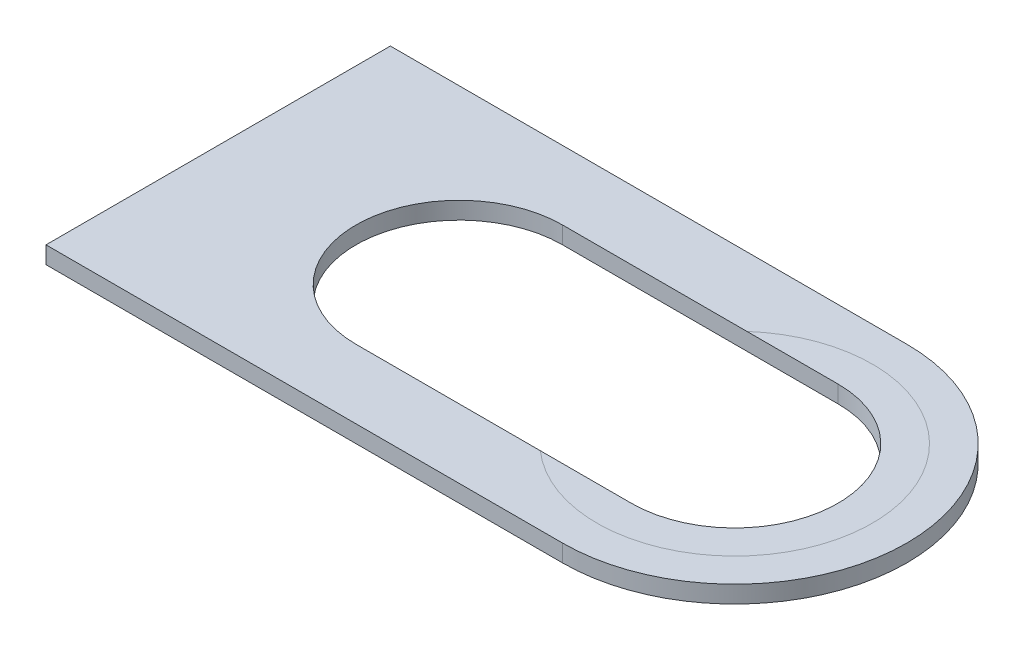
ISO-10303-21;
HEADER;
FILE_DESCRIPTION(('STEP AP214'),'2;1');
FILE_NAME('part.step','',(''),(''),'','','');
FILE_SCHEMA(('AUTOMOTIVE_DESIGN { 1 0 10303 214 1 1 1 1 }'));
ENDSEC;
DATA;
#1=APPLICATION_CONTEXT('core data for automotive mechanical design processes');
#2=APPLICATION_PROTOCOL_DEFINITION('international standard','automotive_design',2000,#1);
#3=PRODUCT_CONTEXT('',#1,'mechanical');
#4=PRODUCT('Part','Part','',(#3));
#5=PRODUCT_RELATED_PRODUCT_CATEGORY('part','',(#4));
#6=PRODUCT_DEFINITION_FORMATION('','',#4);
#7=PRODUCT_DEFINITION_CONTEXT('part definition',#1,'design');
#8=PRODUCT_DEFINITION('design','',#6,#7);
#9=PRODUCT_DEFINITION_SHAPE('','',#8);
#10=(LENGTH_UNIT() NAMED_UNIT(*) SI_UNIT(.MILLI.,.METRE.));
#11=(NAMED_UNIT(*) PLANE_ANGLE_UNIT() SI_UNIT($,.RADIAN.));
#12=(NAMED_UNIT(*) SI_UNIT($,.STERADIAN.) SOLID_ANGLE_UNIT());
#13=UNCERTAINTY_MEASURE_WITH_UNIT(LENGTH_MEASURE(1.E-05),#10,'distance_accuracy_value','');
#14=(GEOMETRIC_REPRESENTATION_CONTEXT(3) GLOBAL_UNCERTAINTY_ASSIGNED_CONTEXT((#13)) GLOBAL_UNIT_ASSIGNED_CONTEXT((#10,
#11,#12)) REPRESENTATION_CONTEXT('',''));
#15=CARTESIAN_POINT('',(0.,0.,0.));
#16=DIRECTION('',(0.,0.,1.));
#17=DIRECTION('',(1.,0.,0.));
#18=AXIS2_PLACEMENT_3D('',#15,#16,#17);
#19=CARTESIAN_POINT('',(0.,5.,50.));
#20=DIRECTION('',(0.,-1.,0.));
#21=DIRECTION('',(1.,0.,0.));
#22=AXIS2_PLACEMENT_3D('',#19,#20,#21);
#23=PLANE('',#22);
#24=CARTESIAN_POINT('',(-50.,4.99999999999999,0.));
#25=DIRECTION('',(0.,1.,0.));
#26=DIRECTION('',(-1.,0.,0.));
#27=AXIS2_PLACEMENT_3D('',#24,#25,#26);
#28=CIRCLE('',#27,50.);
#29=CARTESIAN_POINT('',(-50.,4.99999999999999,50.));
#30=VERTEX_POINT('',#29);
#31=CARTESIAN_POINT('',(-50.,4.99999999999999,-50.));
#32=VERTEX_POINT('',#31);
#33=EDGE_CURVE('P0_E145',#30,#32,#28,.T.);
#34=ORIENTED_EDGE('',*,*,#33,.T.);
#35=DIRECTION('',(-1.,0.,0.));
#36=VECTOR('',#35,1.);
#37=CARTESIAN_POINT('',(0.,5.,-50.));
#38=LINE('',#37,#36);
#39=CARTESIAN_POINT('',(-200.,4.99999999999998,-50.));
#40=VERTEX_POINT('',#39);
#41=EDGE_CURVE('P0_E154',#32,#40,#38,.T.);
#42=ORIENTED_EDGE('',*,*,#41,.T.);
#43=DIRECTION('',(0.,0.,-1.));
#44=VECTOR('',#43,1.);
#45=CARTESIAN_POINT('',(-200.,4.99999999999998,50.));
#46=LINE('',#45,#44);
#47=CARTESIAN_POINT('',(-200.,4.99999999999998,50.));
#48=VERTEX_POINT('',#47);
#49=EDGE_CURVE('P0_E43',#48,#40,#46,.T.);
#50=ORIENTED_EDGE('',*,*,#49,.F.);
#51=DIRECTION('',(-1.,0.,0.));
#52=VECTOR('',#51,1.);
#53=CARTESIAN_POINT('',(0.,5.,50.));
#54=LINE('',#53,#52);
#55=EDGE_CURVE('P0_E161',#30,#48,#54,.T.);
#56=ORIENTED_EDGE('',*,*,#55,.F.);
#57=EDGE_LOOP('',(#34,#42,#50,#56));
#58=FACE_BOUND('',#57,.T.);
#59=CARTESIAN_POINT('',(-50.,4.99999999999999,0.));
#60=DIRECTION('',(0.,-1.,0.));
#61=DIRECTION('',(1.,0.,0.));
#62=AXIS2_PLACEMENT_3D('',#59,#60,#61);
#63=CIRCLE('',#62,40.);
#64=CARTESIAN_POINT('',(-76.4575131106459,4.99999999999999,30.));
#65=VERTEX_POINT('',#64);
#66=CARTESIAN_POINT('',(-76.4575131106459,4.99999999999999,-30.));
#67=VERTEX_POINT('',#66);
#68=EDGE_CURVE('P0_E11',#65,#67,#63,.F.);
#69=ORIENTED_EDGE('',*,*,#68,.F.);
#70=DIRECTION('',(1.,0.,0.));
#71=VECTOR('',#70,1.);
#72=CARTESIAN_POINT('',(-50.,4.99999999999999,30.));
#73=LINE('',#72,#71);
#74=CARTESIAN_POINT('',(-130.,4.99999999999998,30.));
#75=VERTEX_POINT('',#74);
#76=EDGE_CURVE('P0_E124',#75,#65,#73,.T.);
#77=ORIENTED_EDGE('',*,*,#76,.F.);
#78=CARTESIAN_POINT('',(-130.,4.99999999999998,0.));
#79=DIRECTION('',(0.,1.,0.));
#80=DIRECTION('',(-1.,0.,0.));
#81=AXIS2_PLACEMENT_3D('',#78,#79,#80);
#82=CIRCLE('',#81,30.);
#83=CARTESIAN_POINT('',(-130.,4.99999999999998,-30.));
#84=VERTEX_POINT('',#83);
#85=EDGE_CURVE('P0_E117',#84,#75,#82,.T.);
#86=ORIENTED_EDGE('',*,*,#85,.F.);
#87=DIRECTION('',(-1.,0.,0.));
#88=VECTOR('',#87,1.);
#89=CARTESIAN_POINT('',(-50.,4.99999999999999,-30.));
#90=LINE('',#89,#88);
#91=EDGE_CURVE('P0_E103',#67,#84,#90,.T.);
#92=ORIENTED_EDGE('',*,*,#91,.F.);
#93=EDGE_LOOP('',(#69,#77,#86,#92));
#94=FACE_BOUND('',#93,.T.);
#95=ADVANCED_FACE('P0_F34',(#58,#94),#23,.F.);
#96=CARTESIAN_POINT('',(-50.,4.99999999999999,0.));
#97=DIRECTION('',(0.,-1.,0.));
#98=DIRECTION('',(1.,0.,0.));
#99=AXIS2_PLACEMENT_3D('',#96,#97,#98);
#100=CYLINDRICAL_SURFACE('',#99,50.);
#101=DIRECTION('',(0.,-1.,0.));
#102=VECTOR('',#101,1.);
#103=CARTESIAN_POINT('',(-50.,4.99999999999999,-50.));
#104=LINE('',#103,#102);
#105=CARTESIAN_POINT('',(-50.,0.,-50.));
#106=VERTEX_POINT('',#105);
#107=EDGE_CURVE('P0_E147',#32,#106,#104,.T.);
#108=ORIENTED_EDGE('',*,*,#107,.F.);
#109=ORIENTED_EDGE('',*,*,#33,.F.);
#110=DIRECTION('',(0.,-1.,0.));
#111=VECTOR('',#110,1.);
#112=CARTESIAN_POINT('',(-50.,4.99999999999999,50.));
#113=LINE('',#112,#111);
#114=CARTESIAN_POINT('',(-50.,0.,50.));
#115=VERTEX_POINT('',#114);
#116=EDGE_CURVE('P0_E142',#30,#115,#113,.T.);
#117=ORIENTED_EDGE('',*,*,#116,.T.);
#118=CARTESIAN_POINT('',(-50.,0.,0.));
#119=DIRECTION('',(0.,-1.,0.));
#120=DIRECTION('',(1.,0.,0.));
#121=AXIS2_PLACEMENT_3D('',#118,#119,#120);
#122=CIRCLE('',#121,50.);
#123=EDGE_CURVE('P0_E149',#115,#106,#122,.F.);
#124=ORIENTED_EDGE('',*,*,#123,.T.);
#125=EDGE_LOOP('',(#108,#109,#117,#124));
#126=FACE_BOUND('',#125,.T.);
#127=ADVANCED_FACE('P0_F191',(#126),#100,.T.);
#128=CARTESIAN_POINT('',(0.,5.,50.));
#129=DIRECTION('',(0.,0.,1.));
#130=DIRECTION('',(1.,0.,0.));
#131=AXIS2_PLACEMENT_3D('',#128,#129,#130);
#132=PLANE('',#131);
#133=DIRECTION('',(-1.,0.,0.));
#134=VECTOR('',#133,1.);
#135=CARTESIAN_POINT('',(0.,0.,50.));
#136=LINE('',#135,#134);
#137=CARTESIAN_POINT('',(-200.,0.,50.));
#138=VERTEX_POINT('',#137);
#139=EDGE_CURVE('P0_E166',#115,#138,#136,.T.);
#140=ORIENTED_EDGE('',*,*,#139,.F.);
#141=ORIENTED_EDGE('',*,*,#116,.F.);
#142=ORIENTED_EDGE('',*,*,#55,.T.);
#143=DIRECTION('',(0.,1.,0.));
#144=VECTOR('',#143,1.);
#145=CARTESIAN_POINT('',(-200.,0.,50.));
#146=LINE('',#145,#144);
#147=EDGE_CURVE('P0_E163',#138,#48,#146,.T.);
#148=ORIENTED_EDGE('',*,*,#147,.F.);
#149=EDGE_LOOP('',(#140,#141,#142,#148));
#150=FACE_BOUND('',#149,.T.);
#151=ADVANCED_FACE('P0_F188',(#150),#132,.T.);
#152=CARTESIAN_POINT('',(0.,5.,-50.));
#153=DIRECTION('',(0.,0.,1.));
#154=DIRECTION('',(1.,0.,0.));
#155=AXIS2_PLACEMENT_3D('',#152,#153,#154);
#156=PLANE('',#155);
#157=ORIENTED_EDGE('',*,*,#107,.T.);
#158=DIRECTION('',(-1.,0.,0.));
#159=VECTOR('',#158,1.);
#160=CARTESIAN_POINT('',(0.,0.,-50.));
#161=LINE('',#160,#159);
#162=CARTESIAN_POINT('',(-200.,0.,-50.));
#163=VERTEX_POINT('',#162);
#164=EDGE_CURVE('P0_E159',#106,#163,#161,.T.);
#165=ORIENTED_EDGE('',*,*,#164,.T.);
#166=DIRECTION('',(0.,1.,0.));
#167=VECTOR('',#166,1.);
#168=CARTESIAN_POINT('',(-200.,0.,-50.));
#169=LINE('',#168,#167);
#170=EDGE_CURVE('P0_E156',#163,#40,#169,.T.);
#171=ORIENTED_EDGE('',*,*,#170,.T.);
#172=ORIENTED_EDGE('',*,*,#41,.F.);
#173=EDGE_LOOP('',(#157,#165,#171,#172));
#174=FACE_BOUND('',#173,.T.);
#175=ADVANCED_FACE('P0_F181',(#174),#156,.F.);
#176=CARTESIAN_POINT('',(-50.,4.99999999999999,30.));
#177=VERTEX_POINT('',#176);
#178=EDGE_CURVE('P0_E125',#65,#177,#73,.T.);
#179=ORIENTED_EDGE('',*,*,#178,.F.);
#180=ORIENTED_EDGE('',*,*,#68,.T.);
#181=CARTESIAN_POINT('',(-50.,4.99999999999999,-30.));
#182=VERTEX_POINT('',#181);
#183=EDGE_CURVE('P0_E110',#182,#67,#90,.T.);
#184=ORIENTED_EDGE('',*,*,#183,.F.);
#185=CARTESIAN_POINT('',(-50.,4.99999999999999,0.));
#186=DIRECTION('',(0.,1.,0.));
#187=DIRECTION('',(-1.,0.,0.));
#188=AXIS2_PLACEMENT_3D('',#185,#186,#187);
#189=CIRCLE('',#188,30.);
#190=EDGE_CURVE('P0_E112',#177,#182,#189,.T.);
#191=ORIENTED_EDGE('',*,*,#190,.F.);
#192=EDGE_LOOP('',(#179,#180,#184,#191));
#193=FACE_BOUND('',#192,.T.);
#194=ADVANCED_FACE('P0_F36',(#193),#23,.F.);
#195=CARTESIAN_POINT('',(-200.,0.,50.));
#196=DIRECTION('',(-1.,0.,0.));
#197=DIRECTION('',(0.,0.,1.));
#198=AXIS2_PLACEMENT_3D('',#195,#196,#197);
#199=PLANE('',#198);
#200=ORIENTED_EDGE('',*,*,#170,.F.);
#201=DIRECTION('',(0.,0.,-1.));
#202=VECTOR('',#201,1.);
#203=CARTESIAN_POINT('',(-200.,0.,50.));
#204=LINE('',#203,#202);
#205=EDGE_CURVE('P0_E168',#138,#163,#204,.T.);
#206=ORIENTED_EDGE('',*,*,#205,.F.);
#207=ORIENTED_EDGE('',*,*,#147,.T.);
#208=ORIENTED_EDGE('',*,*,#49,.T.);
#209=EDGE_LOOP('',(#200,#206,#207,#208));
#210=FACE_BOUND('',#209,.T.);
#211=ADVANCED_FACE('P0_F174',(#210),#199,.T.);
#212=CARTESIAN_POINT('',(0.,0.,50.));
#213=DIRECTION('',(0.,-1.,0.));
#214=DIRECTION('',(1.,0.,0.));
#215=AXIS2_PLACEMENT_3D('',#212,#213,#214);
#216=PLANE('',#215);
#217=CARTESIAN_POINT('',(-50.,0.,0.));
#218=DIRECTION('',(0.,1.,0.));
#219=DIRECTION('',(-1.,0.,0.));
#220=AXIS2_PLACEMENT_3D('',#217,#218,#219);
#221=CIRCLE('',#220,30.);
#222=CARTESIAN_POINT('',(-50.,0.,30.));
#223=VERTEX_POINT('',#222);
#224=CARTESIAN_POINT('',(-50.,0.,-30.));
#225=VERTEX_POINT('',#224);
#226=EDGE_CURVE('P0_E130',#223,#225,#221,.T.);
#227=ORIENTED_EDGE('',*,*,#226,.T.);
#228=DIRECTION('',(-1.,0.,0.));
#229=VECTOR('',#228,1.);
#230=CARTESIAN_POINT('',(-50.,0.,-30.));
#231=LINE('',#230,#229);
#232=CARTESIAN_POINT('',(-130.,0.,-30.));
#233=VERTEX_POINT('',#232);
#234=EDGE_CURVE('P0_E133',#225,#233,#231,.T.);
#235=ORIENTED_EDGE('',*,*,#234,.T.);
#236=CARTESIAN_POINT('',(-130.,0.,0.));
#237=DIRECTION('',(0.,1.,0.));
#238=DIRECTION('',(-1.,0.,0.));
#239=AXIS2_PLACEMENT_3D('',#236,#237,#238);
#240=CIRCLE('',#239,30.);
#241=CARTESIAN_POINT('',(-130.,0.,30.));
#242=VERTEX_POINT('',#241);
#243=EDGE_CURVE('P0_E119',#233,#242,#240,.T.);
#244=ORIENTED_EDGE('',*,*,#243,.T.);
#245=DIRECTION('',(1.,0.,0.));
#246=VECTOR('',#245,1.);
#247=CARTESIAN_POINT('',(-50.,0.,30.));
#248=LINE('',#247,#246);
#249=EDGE_CURVE('P0_E136',#242,#223,#248,.T.);
#250=ORIENTED_EDGE('',*,*,#249,.T.);
#251=EDGE_LOOP('',(#227,#235,#244,#250));
#252=FACE_BOUND('',#251,.T.);
#253=ORIENTED_EDGE('',*,*,#123,.F.);
#254=ORIENTED_EDGE('',*,*,#139,.T.);
#255=ORIENTED_EDGE('',*,*,#205,.T.);
#256=ORIENTED_EDGE('',*,*,#164,.F.);
#257=EDGE_LOOP('',(#253,#254,#255,#256));
#258=FACE_BOUND('',#257,.T.);
#259=ADVANCED_FACE('P0_F185',(#252,#258),#216,.T.);
#260=CARTESIAN_POINT('',(-50.,0.,0.));
#261=DIRECTION('',(0.,1.,0.));
#262=DIRECTION('',(-1.,0.,0.));
#263=AXIS2_PLACEMENT_3D('',#260,#261,#262);
#264=CYLINDRICAL_SURFACE('',#263,30.);
#265=ORIENTED_EDGE('',*,*,#190,.T.);
#266=DIRECTION('',(0.,1.,0.));
#267=VECTOR('',#266,1.);
#268=CARTESIAN_POINT('',(-50.,0.,-30.));
#269=LINE('',#268,#267);
#270=EDGE_CURVE('P0_E121',#225,#182,#269,.T.);
#271=ORIENTED_EDGE('',*,*,#270,.F.);
#272=ORIENTED_EDGE('',*,*,#226,.F.);
#273=DIRECTION('',(0.,1.,0.));
#274=VECTOR('',#273,1.);
#275=CARTESIAN_POINT('',(-50.,0.,30.));
#276=LINE('',#275,#274);
#277=EDGE_CURVE('P0_E139',#223,#177,#276,.T.);
#278=ORIENTED_EDGE('',*,*,#277,.T.);
#279=EDGE_LOOP('',(#265,#271,#272,#278));
#280=FACE_BOUND('',#279,.T.);
#281=ADVANCED_FACE('P0_F202',(#280),#264,.F.);
#282=CARTESIAN_POINT('',(-50.,0.,30.));
#283=DIRECTION('',(0.,0.,1.));
#284=DIRECTION('',(1.,0.,0.));
#285=AXIS2_PLACEMENT_3D('',#282,#283,#284);
#286=PLANE('',#285);
#287=ORIENTED_EDGE('',*,*,#76,.T.);
#288=ORIENTED_EDGE('',*,*,#178,.T.);
#289=ORIENTED_EDGE('',*,*,#277,.F.);
#290=ORIENTED_EDGE('',*,*,#249,.F.);
#291=DIRECTION('',(0.,1.,0.));
#292=VECTOR('',#291,1.);
#293=CARTESIAN_POINT('',(-130.,0.,30.));
#294=LINE('',#293,#292);
#295=EDGE_CURVE('P0_E120',#242,#75,#294,.T.);
#296=ORIENTED_EDGE('',*,*,#295,.T.);
#297=EDGE_LOOP('',(#287,#288,#289,#290,#296));
#298=FACE_BOUND('',#297,.T.);
#299=ADVANCED_FACE('P0_F214',(#298),#286,.F.);
#300=CARTESIAN_POINT('',(-130.,0.,0.));
#301=DIRECTION('',(0.,1.,0.));
#302=DIRECTION('',(-1.,0.,0.));
#303=AXIS2_PLACEMENT_3D('',#300,#301,#302);
#304=CYLINDRICAL_SURFACE('',#303,30.);
#305=ORIENTED_EDGE('',*,*,#85,.T.);
#306=ORIENTED_EDGE('',*,*,#295,.F.);
#307=ORIENTED_EDGE('',*,*,#243,.F.);
#308=DIRECTION('',(0.,1.,0.));
#309=VECTOR('',#308,1.);
#310=CARTESIAN_POINT('',(-130.,0.,-30.));
#311=LINE('',#310,#309);
#312=EDGE_CURVE('P0_E107',#233,#84,#311,.T.);
#313=ORIENTED_EDGE('',*,*,#312,.T.);
#314=EDGE_LOOP('',(#305,#306,#307,#313));
#315=FACE_BOUND('',#314,.T.);
#316=ADVANCED_FACE('P0_F116',(#315),#304,.F.);
#317=CARTESIAN_POINT('',(-50.,0.,-30.));
#318=DIRECTION('',(0.,0.,-1.));
#319=DIRECTION('',(-1.,0.,0.));
#320=AXIS2_PLACEMENT_3D('',#317,#318,#319);
#321=PLANE('',#320);
#322=ORIENTED_EDGE('',*,*,#183,.T.);
#323=ORIENTED_EDGE('',*,*,#91,.T.);
#324=ORIENTED_EDGE('',*,*,#312,.F.);
#325=ORIENTED_EDGE('',*,*,#234,.F.);
#326=ORIENTED_EDGE('',*,*,#270,.T.);
#327=EDGE_LOOP('',(#322,#323,#324,#325,#326));
#328=FACE_BOUND('',#327,.T.);
#329=ADVANCED_FACE('P0_F105',(#328),#321,.F.);
#330=CLOSED_SHELL('',(#95,#127,#151,#175,#194,#211,#259,#281,#299,#316,#329));
#331=MANIFOLD_SOLID_BREP('P0_B2',#330);
#332=CARTESIAN_POINT('',(0.,2.5,50.));
#333=DIRECTION('',(0.,-1.,0.));
#334=DIRECTION('',(1.,0.,0.));
#335=AXIS2_PLACEMENT_3D('',#332,#333,#334);
#336=PLANE('',#335);
#337=DIRECTION('',(1.,0.,0.));
#338=VECTOR('',#337,1.);
#339=CARTESIAN_POINT('',(0.,2.5,-50.));
#340=LINE('',#339,#338);
#341=CARTESIAN_POINT('',(-200.,2.49999999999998,-50.));
#342=VERTEX_POINT('',#341);
#343=CARTESIAN_POINT('',(-50.,2.49999999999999,-50.));
#344=VERTEX_POINT('',#343);
#345=EDGE_CURVE('P1_E22',#342,#344,#340,.T.);
#346=ORIENTED_EDGE('',*,*,#345,.T.);
#347=CARTESIAN_POINT('',(-50.,2.49999999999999,0.));
#348=DIRECTION('',(0.,1.,0.));
#349=DIRECTION('',(1.,0.,0.));
#350=AXIS2_PLACEMENT_3D('',#347,#348,#349);
#351=CIRCLE('',#350,50.);
#352=CARTESIAN_POINT('',(-50.,2.49999999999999,50.));
#353=VERTEX_POINT('',#352);
#354=EDGE_CURVE('P1_E70',#344,#353,#351,.F.);
#355=ORIENTED_EDGE('',*,*,#354,.T.);
#356=DIRECTION('',(-1.,0.,0.));
#357=VECTOR('',#356,1.);
#358=CARTESIAN_POINT('',(0.,2.5,50.));
#359=LINE('',#358,#357);
#360=CARTESIAN_POINT('',(-200.,2.49999999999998,50.));
#361=VERTEX_POINT('',#360);
#362=EDGE_CURVE('P1_E72',#353,#361,#359,.T.);
#363=ORIENTED_EDGE('',*,*,#362,.T.);
#364=DIRECTION('',(0.,0.,-1.));
#365=VECTOR('',#364,1.);
#366=CARTESIAN_POINT('',(-200.,2.49999999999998,50.));
#367=LINE('',#366,#365);
#368=EDGE_CURVE('P1_E75',#361,#342,#367,.T.);
#369=ORIENTED_EDGE('',*,*,#368,.T.);
#370=EDGE_LOOP('',(#346,#355,#363,#369));
#371=FACE_BOUND('',#370,.T.);
#372=DIRECTION('',(1.,0.,0.));
#373=VECTOR('',#372,1.);
#374=CARTESIAN_POINT('',(0.,2.5,30.));
#375=LINE('',#374,#373);
#376=CARTESIAN_POINT('',(-130.,2.49999999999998,30.));
#377=VERTEX_POINT('',#376);
#378=CARTESIAN_POINT('',(-76.4575131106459,2.49999999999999,30.));
#379=VERTEX_POINT('',#378);
#380=EDGE_CURVE('P1_E18',#377,#379,#375,.T.);
#381=ORIENTED_EDGE('',*,*,#380,.T.);
#382=CARTESIAN_POINT('',(-50.,2.49999999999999,0.));
#383=DIRECTION('',(0.,-1.,0.));
#384=DIRECTION('',(1.,0.,0.));
#385=AXIS2_PLACEMENT_3D('',#382,#383,#384);
#386=CIRCLE('',#385,40.);
#387=CARTESIAN_POINT('',(-76.4575131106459,2.49999999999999,-30.));
#388=VERTEX_POINT('',#387);
#389=EDGE_CURVE('P1_E11',#379,#388,#386,.F.);
#390=ORIENTED_EDGE('',*,*,#389,.T.);
#391=DIRECTION('',(-1.,0.,0.));
#392=VECTOR('',#391,1.);
#393=CARTESIAN_POINT('',(0.,2.5,-30.));
#394=LINE('',#393,#392);
#395=CARTESIAN_POINT('',(-130.,2.49999999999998,-30.));
#396=VERTEX_POINT('',#395);
#397=EDGE_CURVE('P1_E59',#388,#396,#394,.T.);
#398=ORIENTED_EDGE('',*,*,#397,.T.);
#399=CARTESIAN_POINT('',(-130.,2.49999999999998,0.));
#400=DIRECTION('',(0.,1.,0.));
#401=DIRECTION('',(1.,0.,0.));
#402=AXIS2_PLACEMENT_3D('',#399,#400,#401);
#403=CIRCLE('',#402,30.);
#404=EDGE_CURVE('P1_E68',#396,#377,#403,.T.);
#405=ORIENTED_EDGE('',*,*,#404,.T.);
#406=EDGE_LOOP('',(#381,#390,#398,#405));
#407=FACE_BOUND('',#406,.T.);
#408=ADVANCED_FACE('P1_F16',(#371,#407),#336,.T.);
#409=ORIENTED_EDGE('',*,*,#389,.F.);
#410=DIRECTION('',(1.,0.,0.));
#411=VECTOR('',#410,1.);
#412=CARTESIAN_POINT('',(0.,2.5,30.));
#413=LINE('',#412,#411);
#414=CARTESIAN_POINT('',(-50.,2.49999999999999,30.));
#415=VERTEX_POINT('',#414);
#416=EDGE_CURVE('P1_E63',#379,#415,#413,.T.);
#417=ORIENTED_EDGE('',*,*,#416,.T.);
#418=CARTESIAN_POINT('',(-50.,2.49999999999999,0.));
#419=DIRECTION('',(0.,1.,0.));
#420=DIRECTION('',(1.,0.,0.));
#421=AXIS2_PLACEMENT_3D('',#418,#419,#420);
#422=CIRCLE('',#421,30.);
#423=CARTESIAN_POINT('',(-50.,2.49999999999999,-30.));
#424=VERTEX_POINT('',#423);
#425=EDGE_CURVE('P1_E60',#415,#424,#422,.T.);
#426=ORIENTED_EDGE('',*,*,#425,.T.);
#427=DIRECTION('',(-1.,0.,0.));
#428=VECTOR('',#427,1.);
#429=CARTESIAN_POINT('',(0.,2.5,-30.));
#430=LINE('',#429,#428);
#431=EDGE_CURVE('P1_E30',#424,#388,#430,.T.);
#432=ORIENTED_EDGE('',*,*,#431,.T.);
#433=EDGE_LOOP('',(#409,#417,#426,#432));
#434=FACE_BOUND('',#433,.T.);
#435=ADVANCED_FACE('P1_F17',(#434),#336,.T.);
#436=OPEN_SHELL('',(#408,#435));
#437=SHELL_BASED_SURFACE_MODEL('P1_B1',(#436));
#438=CARTESIAN_POINT('',(0.,2.5,50.));
#439=DIRECTION('',(0.,-1.,0.));
#440=DIRECTION('',(1.,0.,0.));
#441=AXIS2_PLACEMENT_3D('',#438,#439,#440);
#442=PLANE('',#441);
#443=DIRECTION('',(1.,0.,0.));
#444=VECTOR('',#443,1.);
#445=CARTESIAN_POINT('',(0.,2.5,-50.));
#446=LINE('',#445,#444);
#447=CARTESIAN_POINT('',(-200.,2.49999999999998,-50.));
#448=VERTEX_POINT('',#447);
#449=CARTESIAN_POINT('',(-50.,2.49999999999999,-50.));
#450=VERTEX_POINT('',#449);
#451=EDGE_CURVE('P2_E22',#448,#450,#446,.T.);
#452=ORIENTED_EDGE('',*,*,#451,.T.);
#453=CARTESIAN_POINT('',(-50.,2.49999999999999,0.));
#454=DIRECTION('',(0.,1.,0.));
#455=DIRECTION('',(1.,0.,0.));
#456=AXIS2_PLACEMENT_3D('',#453,#454,#455);
#457=CIRCLE('',#456,50.);
#458=CARTESIAN_POINT('',(-50.,2.49999999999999,50.));
#459=VERTEX_POINT('',#458);
#460=EDGE_CURVE('P2_E70',#450,#459,#457,.F.);
#461=ORIENTED_EDGE('',*,*,#460,.T.);
#462=DIRECTION('',(-1.,0.,0.));
#463=VECTOR('',#462,1.);
#464=CARTESIAN_POINT('',(0.,2.5,50.));
#465=LINE('',#464,#463);
#466=CARTESIAN_POINT('',(-200.,2.49999999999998,50.));
#467=VERTEX_POINT('',#466);
#468=EDGE_CURVE('P2_E72',#459,#467,#465,.T.);
#469=ORIENTED_EDGE('',*,*,#468,.T.);
#470=DIRECTION('',(0.,0.,-1.));
#471=VECTOR('',#470,1.);
#472=CARTESIAN_POINT('',(-200.,2.49999999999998,50.));
#473=LINE('',#472,#471);
#474=EDGE_CURVE('P2_E75',#467,#448,#473,.T.);
#475=ORIENTED_EDGE('',*,*,#474,.T.);
#476=EDGE_LOOP('',(#452,#461,#469,#475));
#477=FACE_BOUND('',#476,.T.);
#478=DIRECTION('',(1.,0.,0.));
#479=VECTOR('',#478,1.);
#480=CARTESIAN_POINT('',(0.,2.5,30.));
#481=LINE('',#480,#479);
#482=CARTESIAN_POINT('',(-130.,2.49999999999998,30.));
#483=VERTEX_POINT('',#482);
#484=CARTESIAN_POINT('',(-76.4575131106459,2.49999999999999,30.));
#485=VERTEX_POINT('',#484);
#486=EDGE_CURVE('P2_E18',#483,#485,#481,.T.);
#487=ORIENTED_EDGE('',*,*,#486,.T.);
#488=CARTESIAN_POINT('',(-50.,2.49999999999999,0.));
#489=DIRECTION('',(0.,-1.,0.));
#490=DIRECTION('',(1.,0.,0.));
#491=AXIS2_PLACEMENT_3D('',#488,#489,#490);
#492=CIRCLE('',#491,40.);
#493=CARTESIAN_POINT('',(-76.4575131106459,2.49999999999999,-30.));
#494=VERTEX_POINT('',#493);
#495=EDGE_CURVE('P2_E11',#485,#494,#492,.F.);
#496=ORIENTED_EDGE('',*,*,#495,.T.);
#497=DIRECTION('',(-1.,0.,0.));
#498=VECTOR('',#497,1.);
#499=CARTESIAN_POINT('',(0.,2.5,-30.));
#500=LINE('',#499,#498);
#501=CARTESIAN_POINT('',(-130.,2.49999999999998,-30.));
#502=VERTEX_POINT('',#501);
#503=EDGE_CURVE('P2_E59',#494,#502,#500,.T.);
#504=ORIENTED_EDGE('',*,*,#503,.T.);
#505=CARTESIAN_POINT('',(-130.,2.49999999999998,0.));
#506=DIRECTION('',(0.,1.,0.));
#507=DIRECTION('',(1.,0.,0.));
#508=AXIS2_PLACEMENT_3D('',#505,#506,#507);
#509=CIRCLE('',#508,30.);
#510=EDGE_CURVE('P2_E68',#502,#483,#509,.T.);
#511=ORIENTED_EDGE('',*,*,#510,.T.);
#512=EDGE_LOOP('',(#487,#496,#504,#511));
#513=FACE_BOUND('',#512,.T.);
#514=ADVANCED_FACE('P2_F16',(#477,#513),#442,.T.);
#515=ORIENTED_EDGE('',*,*,#495,.F.);
#516=DIRECTION('',(1.,0.,0.));
#517=VECTOR('',#516,1.);
#518=CARTESIAN_POINT('',(0.,2.5,30.));
#519=LINE('',#518,#517);
#520=CARTESIAN_POINT('',(-50.,2.49999999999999,30.));
#521=VERTEX_POINT('',#520);
#522=EDGE_CURVE('P2_E63',#485,#521,#519,.T.);
#523=ORIENTED_EDGE('',*,*,#522,.T.);
#524=CARTESIAN_POINT('',(-50.,2.49999999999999,0.));
#525=DIRECTION('',(0.,1.,0.));
#526=DIRECTION('',(1.,0.,0.));
#527=AXIS2_PLACEMENT_3D('',#524,#525,#526);
#528=CIRCLE('',#527,30.);
#529=CARTESIAN_POINT('',(-50.,2.49999999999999,-30.));
#530=VERTEX_POINT('',#529);
#531=EDGE_CURVE('P2_E60',#521,#530,#528,.T.);
#532=ORIENTED_EDGE('',*,*,#531,.T.);
#533=DIRECTION('',(-1.,0.,0.));
#534=VECTOR('',#533,1.);
#535=CARTESIAN_POINT('',(0.,2.5,-30.));
#536=LINE('',#535,#534);
#537=EDGE_CURVE('P2_E30',#530,#494,#536,.T.);
#538=ORIENTED_EDGE('',*,*,#537,.T.);
#539=EDGE_LOOP('',(#515,#523,#532,#538));
#540=FACE_BOUND('',#539,.T.);
#541=ADVANCED_FACE('P2_F17',(#540),#442,.T.);
#542=OPEN_SHELL('',(#514,#541));
#543=SHELL_BASED_SURFACE_MODEL('P2_B1',(#542));
#544=ADVANCED_BREP_SHAPE_REPRESENTATION('',(#18,#331),#14);
#545=MANIFOLD_SURFACE_SHAPE_REPRESENTATION('',(#18,#437,#543),#14);
#546=SHAPE_REPRESENTATION('',(#18),#14);
#547=SHAPE_DEFINITION_REPRESENTATION(#9,#546);
#548=SHAPE_REPRESENTATION_RELATIONSHIP('','',#546,#544);
#549=SHAPE_REPRESENTATION_RELATIONSHIP('','',#546,#545);
ENDSEC;
END-ISO-10303-21;
